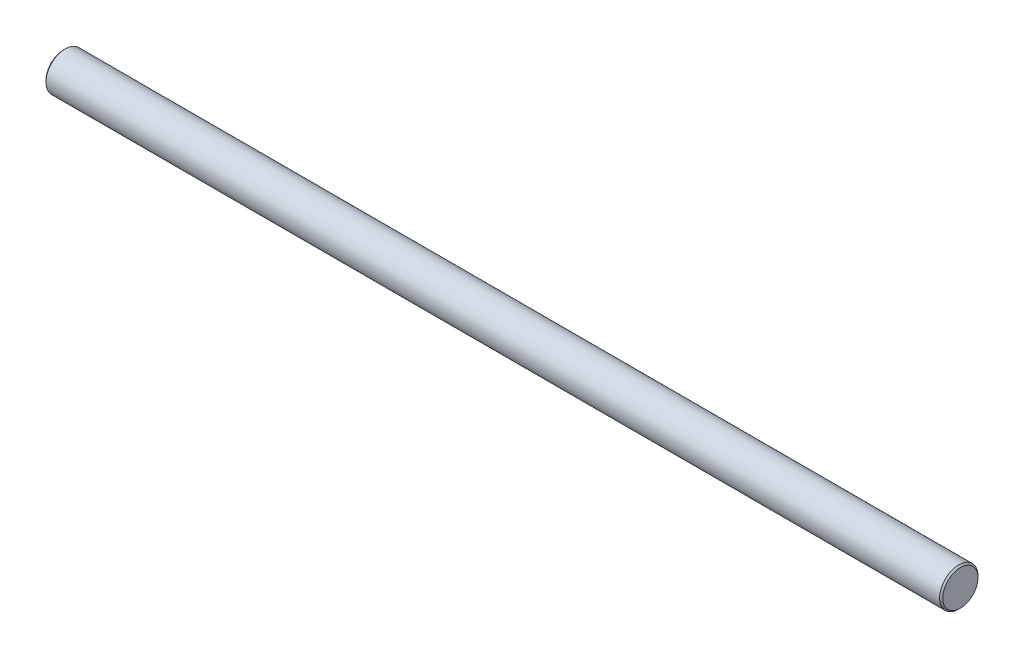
from build123d import *

# Parameters (mm, degrees)
SKETCH_1_R      = 3
EXTRUDE_1_DEPTH = 140
CHAMFER_1_SIZE  = 0.25


with BuildPart() as part:
    # Sketch 1 → Extrude 1 (new body)
    with BuildSketch(Plane(origin=(0, 0, 0), x_dir=(0, 0, -1), z_dir=(1, 0, 0))):
        Circle(SKETCH_1_R)
    extrude(amount=EXTRUDE_1_DEPTH)

    # Chamfer 1
    chamfer_1_edges = [part.edges().sort_by_distance(p)[0] for p in [
        (0, 0, 3),
        (140, 0, 3),
    ]]
    chamfer(chamfer_1_edges, length=CHAMFER_1_SIZE)


solid = part.part
